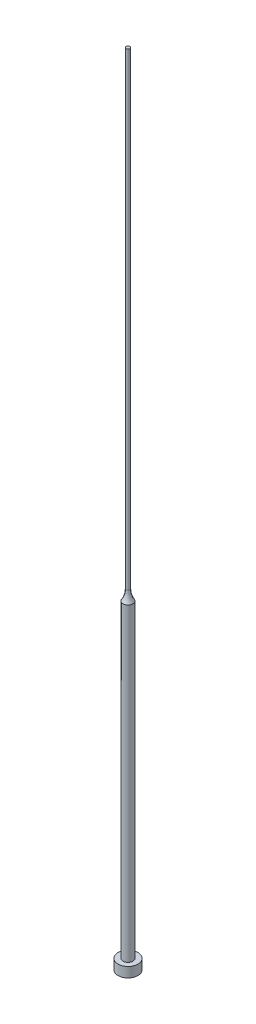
ISO-10303-21;
HEADER;
FILE_DESCRIPTION(('STEP AP214'),'2;1');
FILE_NAME('part.step','',(''),(''),'','','');
FILE_SCHEMA(('AUTOMOTIVE_DESIGN { 1 0 10303 214 1 1 1 1 }'));
ENDSEC;
DATA;
#1=APPLICATION_CONTEXT('core data for automotive mechanical design processes');
#2=APPLICATION_PROTOCOL_DEFINITION('international standard','automotive_design',2000,#1);
#3=PRODUCT_CONTEXT('',#1,'mechanical');
#4=PRODUCT('Part','Part','',(#3));
#5=PRODUCT_RELATED_PRODUCT_CATEGORY('part','',(#4));
#6=PRODUCT_DEFINITION_FORMATION('','',#4);
#7=PRODUCT_DEFINITION_CONTEXT('part definition',#1,'design');
#8=PRODUCT_DEFINITION('design','',#6,#7);
#9=PRODUCT_DEFINITION_SHAPE('','',#8);
#10=(LENGTH_UNIT() NAMED_UNIT(*) SI_UNIT(.MILLI.,.METRE.));
#11=(NAMED_UNIT(*) PLANE_ANGLE_UNIT() SI_UNIT($,.RADIAN.));
#12=(NAMED_UNIT(*) SI_UNIT($,.STERADIAN.) SOLID_ANGLE_UNIT());
#13=UNCERTAINTY_MEASURE_WITH_UNIT(LENGTH_MEASURE(1.E-05),#10,'distance_accuracy_value','');
#14=(GEOMETRIC_REPRESENTATION_CONTEXT(3) GLOBAL_UNCERTAINTY_ASSIGNED_CONTEXT((#13)) GLOBAL_UNIT_ASSIGNED_CONTEXT((#10,
#11,#12)) REPRESENTATION_CONTEXT('',''));
#15=CARTESIAN_POINT('',(0.,0.,0.));
#16=DIRECTION('',(0.,0.,1.));
#17=DIRECTION('',(1.,0.,0.));
#18=AXIS2_PLACEMENT_3D('',#15,#16,#17);
#19=CARTESIAN_POINT('',(0.,0.,0.));
#20=DIRECTION('',(0.,1.,0.));
#21=DIRECTION('',(-1.,0.,0.));
#22=AXIS2_PLACEMENT_3D('',#19,#20,#21);
#23=PLANE('',#22);
#24=CARTESIAN_POINT('',(0.,0.,0.));
#25=DIRECTION('',(0.,1.,0.));
#26=DIRECTION('',(-1.,0.,0.));
#27=AXIS2_PLACEMENT_3D('',#24,#25,#26);
#28=CIRCLE('',#27,3.175);
#29=CARTESIAN_POINT('',(-3.175,0.,0.));
#30=VERTEX_POINT('',#29);
#31=EDGE_CURVE('E37',#30,#30,#28,.T.);
#32=ORIENTED_EDGE('',*,*,#31,.F.);
#33=EDGE_LOOP('',(#32));
#34=FACE_BOUND('',#33,.T.);
#35=ADVANCED_FACE('F30',(#34),#23,.F.);
#36=CARTESIAN_POINT('',(0.,254.,0.));
#37=DIRECTION('',(0.,1.,0.));
#38=DIRECTION('',(-1.,0.,0.));
#39=AXIS2_PLACEMENT_3D('',#36,#37,#38);
#40=CYLINDRICAL_SURFACE('',#39,3.175);
#41=CARTESIAN_POINT('',(0.,3.17499999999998,0.));
#42=DIRECTION('',(0.,1.,0.));
#43=DIRECTION('',(-1.,0.,0.));
#44=AXIS2_PLACEMENT_3D('',#41,#42,#43);
#45=CIRCLE('',#44,3.175);
#46=CARTESIAN_POINT('',(-3.175,3.17499999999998,0.));
#47=VERTEX_POINT('',#46);
#48=EDGE_CURVE('E41',#47,#47,#45,.T.);
#49=ORIENTED_EDGE('',*,*,#48,.F.);
#50=EDGE_LOOP('',(#49));
#51=FACE_BOUND('',#50,.T.);
#52=ORIENTED_EDGE('',*,*,#31,.T.);
#53=EDGE_LOOP('',(#52));
#54=FACE_BOUND('',#53,.T.);
#55=ADVANCED_FACE('F72',(#51,#54),#40,.T.);
#56=CARTESIAN_POINT('',(3.175,3.175,0.));
#57=DIRECTION('',(0.,-1.,0.));
#58=DIRECTION('',(1.,0.,0.));
#59=AXIS2_PLACEMENT_3D('',#56,#57,#58);
#60=PLANE('',#59);
#61=CARTESIAN_POINT('',(0.,3.17499999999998,0.));
#62=DIRECTION('',(0.,1.,0.));
#63=DIRECTION('',(-1.,0.,0.));
#64=AXIS2_PLACEMENT_3D('',#61,#62,#63);
#65=CIRCLE('',#64,1.58750000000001);
#66=CARTESIAN_POINT('',(-1.58750000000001,3.17499999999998,0.));
#67=VERTEX_POINT('',#66);
#68=EDGE_CURVE('E45',#67,#67,#65,.T.);
#69=ORIENTED_EDGE('',*,*,#68,.F.);
#70=EDGE_LOOP('',(#69));
#71=FACE_BOUND('',#70,.T.);
#72=ORIENTED_EDGE('',*,*,#48,.T.);
#73=EDGE_LOOP('',(#72));
#74=FACE_BOUND('',#73,.T.);
#75=ADVANCED_FACE('F68',(#71,#74),#60,.F.);
#76=CARTESIAN_POINT('',(0.,254.,0.));
#77=DIRECTION('',(0.,1.,0.));
#78=DIRECTION('',(-1.,0.,0.));
#79=AXIS2_PLACEMENT_3D('',#76,#77,#78);
#80=CYLINDRICAL_SURFACE('',#79,1.58750000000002);
#81=CARTESIAN_POINT('',(0.,101.6,0.));
#82=DIRECTION('',(0.,1.,0.));
#83=DIRECTION('',(-1.,0.,0.));
#84=AXIS2_PLACEMENT_3D('',#81,#82,#83);
#85=CIRCLE('',#84,1.58750000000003);
#86=CARTESIAN_POINT('',(-1.58750000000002,101.6,0.));
#87=VERTEX_POINT('',#86);
#88=EDGE_CURVE('E50',#87,#87,#85,.T.);
#89=ORIENTED_EDGE('',*,*,#88,.F.);
#90=EDGE_LOOP('',(#89));
#91=FACE_BOUND('',#90,.T.);
#92=ORIENTED_EDGE('',*,*,#68,.T.);
#93=EDGE_LOOP('',(#92));
#94=FACE_BOUND('',#93,.T.);
#95=ADVANCED_FACE('F61',(#91,#94),#80,.T.);
#96=CARTESIAN_POINT('',(0.,254.,0.));
#97=DIRECTION('',(0.,1.,0.));
#98=DIRECTION('',(-1.,0.,0.));
#99=AXIS2_PLACEMENT_3D('',#96,#97,#98);
#100=CYLINDRICAL_SURFACE('',#99,0.594360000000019);
#101=CARTESIAN_POINT('',(0.,105.009772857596,0.));
#102=DIRECTION('',(0.,-1.,0.));
#103=DIRECTION('',(1.,0.,0.));
#104=AXIS2_PLACEMENT_3D('',#101,#102,#103);
#105=CIRCLE('',#104,0.594360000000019);
#106=CARTESIAN_POINT('',(0.594360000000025,105.009772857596,0.));
#107=VERTEX_POINT('',#106);
#108=EDGE_CURVE('E10',#107,#107,#105,.F.);
#109=ORIENTED_EDGE('',*,*,#108,.T.);
#110=EDGE_LOOP('',(#109));
#111=FACE_BOUND('',#110,.T.);
#112=CARTESIAN_POINT('',(0.,254.,0.));
#113=DIRECTION('',(0.,1.,0.));
#114=DIRECTION('',(-1.,0.,0.));
#115=AXIS2_PLACEMENT_3D('',#112,#113,#114);
#116=CIRCLE('',#115,0.594360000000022);
#117=CARTESIAN_POINT('',(-0.594360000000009,254.,0.));
#118=VERTEX_POINT('',#117);
#119=EDGE_CURVE('E53',#118,#118,#116,.T.);
#120=ORIENTED_EDGE('',*,*,#119,.F.);
#121=EDGE_LOOP('',(#120));
#122=FACE_BOUND('',#121,.T.);
#123=ADVANCED_FACE('F59',(#111,#122),#100,.T.);
#124=CARTESIAN_POINT('',(0.594360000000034,254.,0.));
#125=DIRECTION('',(0.,-1.,0.));
#126=DIRECTION('',(1.,0.,0.));
#127=AXIS2_PLACEMENT_3D('',#124,#125,#126);
#128=PLANE('',#127);
#129=ORIENTED_EDGE('',*,*,#119,.T.);
#130=EDGE_LOOP('',(#129));
#131=FACE_BOUND('',#130,.T.);
#132=ADVANCED_FACE('F57',(#131),#128,.F.);
#133=CARTESIAN_POINT('',(0.,105.009772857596,0.));
#134=DIRECTION('',(0.,-1.,0.));
#135=DIRECTION('',(1.,0.,0.));
#136=AXIS2_PLACEMENT_3D('',#133,#134,#135);
#137=TOROIDAL_SURFACE('',#136,6.94436000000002,6.35);
#138=ORIENTED_EDGE('',*,*,#88,.T.);
#139=EDGE_LOOP('',(#138));
#140=FACE_BOUND('',#139,.T.);
#141=ORIENTED_EDGE('',*,*,#108,.F.);
#142=EDGE_LOOP('',(#141));
#143=FACE_BOUND('',#142,.T.);
#144=ADVANCED_FACE('F32',(#140,#143),#137,.F.);
#145=CLOSED_SHELL('',(#35,#55,#75,#95,#123,#132,#144));
#146=MANIFOLD_SOLID_BREP('B2',#145);
#147=ADVANCED_BREP_SHAPE_REPRESENTATION('',(#18,#146),#14);
#148=SHAPE_DEFINITION_REPRESENTATION(#9,#147);
ENDSEC;
END-ISO-10303-21;
